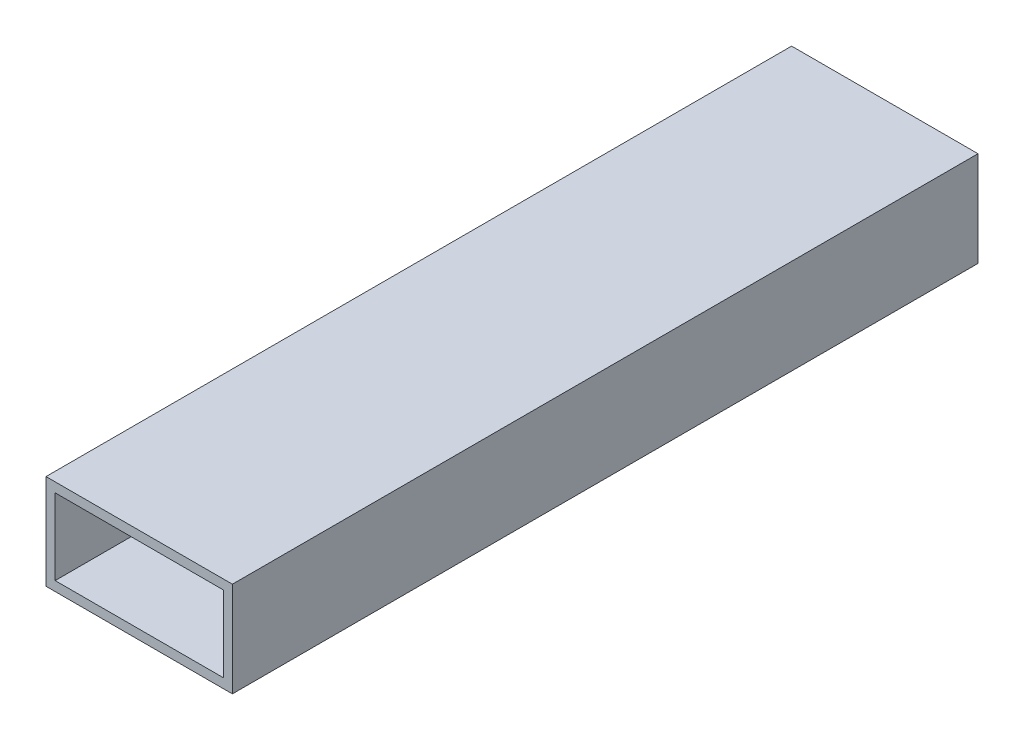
from build123d import *

# Parameters (mm, degrees)
SKETCH_1_W      = 25.5
SKETCH_1_H      = 13
SKETCH_1_W_2    = 23
SKETCH_1_H_2    = 10.4
EXTRUDE_1_DEPTH = 102


with BuildPart() as part:
    # Sketch 1 → Extrude 1 (new body)
    with BuildSketch(Plane.XY):
        Rectangle(SKETCH_1_W, SKETCH_1_H)
        Rectangle(SKETCH_1_W_2, SKETCH_1_H_2, mode=Mode.SUBTRACT)
    extrude(amount=EXTRUDE_1_DEPTH)


solid = part.part
